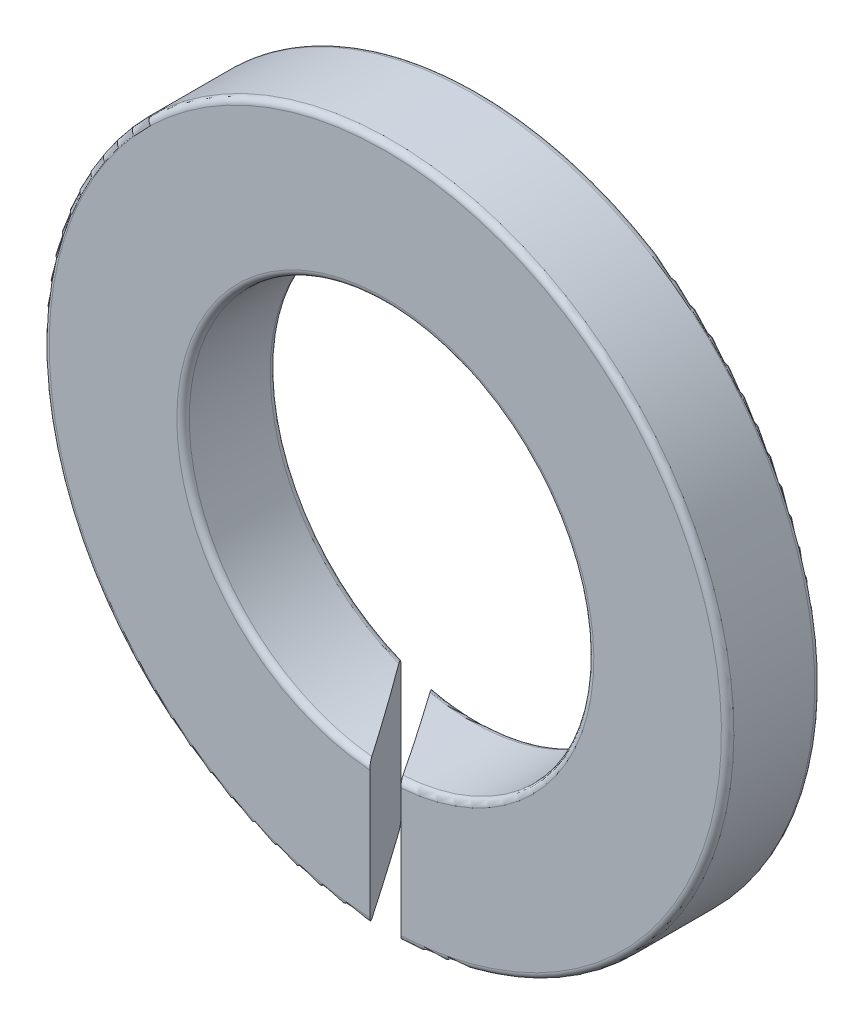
ISO-10303-21;
HEADER;
FILE_DESCRIPTION(('STEP AP214'),'2;1');
FILE_NAME('part.step','',(''),(''),'','','');
FILE_SCHEMA(('AUTOMOTIVE_DESIGN { 1 0 10303 214 1 1 1 1 }'));
ENDSEC;
DATA;
#1=APPLICATION_CONTEXT('core data for automotive mechanical design processes');
#2=APPLICATION_PROTOCOL_DEFINITION('international standard','automotive_design',2000,#1);
#3=PRODUCT_CONTEXT('',#1,'mechanical');
#4=PRODUCT('Part','Part','',(#3));
#5=PRODUCT_RELATED_PRODUCT_CATEGORY('part','',(#4));
#6=PRODUCT_DEFINITION_FORMATION('','',#4);
#7=PRODUCT_DEFINITION_CONTEXT('part definition',#1,'design');
#8=PRODUCT_DEFINITION('design','',#6,#7);
#9=PRODUCT_DEFINITION_SHAPE('','',#8);
#10=(LENGTH_UNIT() NAMED_UNIT(*) SI_UNIT(.MILLI.,.METRE.));
#11=(NAMED_UNIT(*) PLANE_ANGLE_UNIT() SI_UNIT($,.RADIAN.));
#12=(NAMED_UNIT(*) SI_UNIT($,.STERADIAN.) SOLID_ANGLE_UNIT());
#13=UNCERTAINTY_MEASURE_WITH_UNIT(LENGTH_MEASURE(1.E-05),#10,'distance_accuracy_value','');
#14=(GEOMETRIC_REPRESENTATION_CONTEXT(3) GLOBAL_UNCERTAINTY_ASSIGNED_CONTEXT((#13)) GLOBAL_UNIT_ASSIGNED_CONTEXT((#10,
#11,#12)) REPRESENTATION_CONTEXT('',''));
#15=CARTESIAN_POINT('',(0.,0.,0.));
#16=DIRECTION('',(0.,0.,1.));
#17=DIRECTION('',(1.,0.,0.));
#18=AXIS2_PLACEMENT_3D('',#15,#16,#17);
#19=CARTESIAN_POINT('',(0.,0.,-1.5));
#20=DIRECTION('',(0.,0.,1.));
#21=DIRECTION('',(1.,0.,0.));
#22=AXIS2_PLACEMENT_3D('',#19,#20,#21);
#23=CYLINDRICAL_SURFACE('',#22,5.5);
#24=CARTESIAN_POINT('',(0.,0.,-0.375));
#25=DIRECTION('',(0.832050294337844,0.,-0.554700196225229));
#26=DIRECTION('',(0.554700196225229,0.,0.832050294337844));
#27=AXIS2_PLACEMENT_3D('',#24,#25,#26);
#28=ELLIPSE('',#27,9.91526600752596,5.5);
#29=CARTESIAN_POINT('',(-0.683333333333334,-5.45738541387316,-1.4));
#30=VERTEX_POINT('',#29);
#31=CARTESIAN_POINT('',(0.183333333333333,-5.49694359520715,-0.0999999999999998));
#32=VERTEX_POINT('',#31);
#33=EDGE_CURVE('E196',#30,#32,#28,.F.);
#34=ORIENTED_EDGE('',*,*,#33,.F.);
#35=CARTESIAN_POINT('',(0.,0.,-1.4));
#36=DIRECTION('',(0.,0.,1.));
#37=DIRECTION('',(1.,0.,0.));
#38=AXIS2_PLACEMENT_3D('',#35,#36,#37);
#39=CIRCLE('',#38,5.5);
#40=CARTESIAN_POINT('',(-1.18333333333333,-5.37119374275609,-1.4));
#41=VERTEX_POINT('',#40);
#42=EDGE_CURVE('E11',#30,#41,#39,.T.);
#43=ORIENTED_EDGE('',*,*,#42,.T.);
#44=CARTESIAN_POINT('',(0.,0.,0.375));
#45=DIRECTION('',(-0.832050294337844,0.,0.554700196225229));
#46=DIRECTION('',(0.554700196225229,0.,0.832050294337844));
#47=AXIS2_PLACEMENT_3D('',#44,#45,#46);
#48=ELLIPSE('',#47,9.91526600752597,5.5);
#49=CARTESIAN_POINT('',(-0.31666666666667,-5.49087627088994,-0.100000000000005));
#50=VERTEX_POINT('',#49);
#51=EDGE_CURVE('E127',#50,#41,#48,.F.);
#52=ORIENTED_EDGE('',*,*,#51,.F.);
#53=CARTESIAN_POINT('',(0.,0.,-0.1));
#54=DIRECTION('',(0.,0.,1.));
#55=DIRECTION('',(1.,0.,0.));
#56=AXIS2_PLACEMENT_3D('',#53,#54,#55);
#57=CIRCLE('',#56,5.5);
#58=EDGE_CURVE('E41',#50,#32,#57,.F.);
#59=ORIENTED_EDGE('',*,*,#58,.T.);
#60=EDGE_LOOP('',(#34,#43,#52,#59));
#61=FACE_BOUND('',#60,.T.);
#62=ADVANCED_FACE('F34',(#61),#23,.T.);
#63=CARTESIAN_POINT('',(0.,0.,-1.5));
#64=DIRECTION('',(0.,0.,1.));
#65=DIRECTION('',(1.,0.,0.));
#66=AXIS2_PLACEMENT_3D('',#63,#64,#65);
#67=PLANE('',#66);
#68=DIRECTION('',(0.,1.,0.));
#69=VECTOR('',#68,1.);
#70=CARTESIAN_POINT('',(-0.750000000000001,-5.5,-1.5));
#71=LINE('',#70,#69);
#72=CARTESIAN_POINT('',(-0.750000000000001,-5.34766304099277,-1.5));
#73=VERTEX_POINT('',#72);
#74=CARTESIAN_POINT('',(-0.750000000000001,-3.2649655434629,-1.5));
#75=VERTEX_POINT('',#74);
#76=EDGE_CURVE('E218',#73,#75,#71,.T.);
#77=ORIENTED_EDGE('',*,*,#76,.T.);
#78=CARTESIAN_POINT('',(0.,0.,-1.5));
#79=DIRECTION('',(0.,0.,1.));
#80=DIRECTION('',(1.,0.,0.));
#81=AXIS2_PLACEMENT_3D('',#78,#79,#80);
#82=CIRCLE('',#81,3.35);
#83=CARTESIAN_POINT('',(-1.25,-3.10805405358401,-1.5));
#84=VERTEX_POINT('',#83);
#85=EDGE_CURVE('E189',#75,#84,#82,.T.);
#86=ORIENTED_EDGE('',*,*,#85,.T.);
#87=DIRECTION('',(0.,1.,0.));
#88=VECTOR('',#87,1.);
#89=CARTESIAN_POINT('',(-1.25,-5.5,-1.5));
#90=LINE('',#89,#88);
#91=CARTESIAN_POINT('',(-1.25,-5.25333227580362,-1.5));
#92=VERTEX_POINT('',#91);
#93=EDGE_CURVE('E205',#92,#84,#90,.T.);
#94=ORIENTED_EDGE('',*,*,#93,.F.);
#95=CARTESIAN_POINT('',(0.,0.,-1.5));
#96=DIRECTION('',(0.,0.,1.));
#97=DIRECTION('',(1.,0.,0.));
#98=AXIS2_PLACEMENT_3D('',#95,#96,#97);
#99=CIRCLE('',#98,5.4);
#100=EDGE_CURVE('E55',#92,#73,#99,.F.);
#101=ORIENTED_EDGE('',*,*,#100,.T.);
#102=EDGE_LOOP('',(#77,#86,#94,#101));
#103=FACE_BOUND('',#102,.T.);
#104=ADVANCED_FACE('F222',(#103),#67,.F.);
#105=CARTESIAN_POINT('',(0.,0.,0.));
#106=DIRECTION('',(0.,0.,1.));
#107=DIRECTION('',(1.,0.,0.));
#108=AXIS2_PLACEMENT_3D('',#105,#106,#107);
#109=PLANE('',#108);
#110=DIRECTION('',(0.,1.,0.));
#111=VECTOR('',#110,1.);
#112=CARTESIAN_POINT('',(-0.25,-5.5,0.));
#113=LINE('',#112,#111);
#114=CARTESIAN_POINT('',(-0.25,-5.39420985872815,0.));
#115=VERTEX_POINT('',#114);
#116=CARTESIAN_POINT('',(-0.25,-3.34065861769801,0.));
#117=VERTEX_POINT('',#116);
#118=EDGE_CURVE('E215',#115,#117,#113,.T.);
#119=ORIENTED_EDGE('',*,*,#118,.T.);
#120=CARTESIAN_POINT('',(0.,0.,0.));
#121=DIRECTION('',(0.,0.,1.));
#122=DIRECTION('',(1.,0.,0.));
#123=AXIS2_PLACEMENT_3D('',#120,#121,#122);
#124=CIRCLE('',#123,3.35);
#125=CARTESIAN_POINT('',(0.25,-3.34065861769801,0.));
#126=VERTEX_POINT('',#125);
#127=EDGE_CURVE('E105',#117,#126,#124,.F.);
#128=ORIENTED_EDGE('',*,*,#127,.T.);
#129=DIRECTION('',(0.,1.,0.));
#130=VECTOR('',#129,1.);
#131=CARTESIAN_POINT('',(0.25,-5.5,0.));
#132=LINE('',#131,#130);
#133=CARTESIAN_POINT('',(0.25,-5.39420985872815,0.));
#134=VERTEX_POINT('',#133);
#135=EDGE_CURVE('E216',#134,#126,#132,.T.);
#136=ORIENTED_EDGE('',*,*,#135,.F.);
#137=CARTESIAN_POINT('',(0.,0.,0.));
#138=DIRECTION('',(0.,0.,1.));
#139=DIRECTION('',(1.,0.,0.));
#140=AXIS2_PLACEMENT_3D('',#137,#138,#139);
#141=CIRCLE('',#140,5.4);
#142=EDGE_CURVE('E110',#134,#115,#141,.T.);
#143=ORIENTED_EDGE('',*,*,#142,.T.);
#144=EDGE_LOOP('',(#119,#128,#136,#143));
#145=FACE_BOUND('',#144,.T.);
#146=ADVANCED_FACE('F214',(#145),#109,.T.);
#147=CARTESIAN_POINT('',(0.,0.,-1.5));
#148=DIRECTION('',(0.,0.,1.));
#149=DIRECTION('',(1.,0.,0.));
#150=AXIS2_PLACEMENT_3D('',#147,#148,#149);
#151=CYLINDRICAL_SURFACE('',#150,3.25);
#152=CARTESIAN_POINT('',(0.,0.,-0.375));
#153=DIRECTION('',(0.832050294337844,0.,-0.554700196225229));
#154=DIRECTION('',(0.554700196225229,0.,0.832050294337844));
#155=AXIS2_PLACEMENT_3D('',#152,#153,#154);
#156=ELLIPSE('',#155,5.85902082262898,3.25);
#157=CARTESIAN_POINT('',(-0.683333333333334,-3.17735039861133,-1.4));
#158=VERTEX_POINT('',#157);
#159=CARTESIAN_POINT('',(0.183333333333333,-3.24482493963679,-0.1));
#160=VERTEX_POINT('',#159);
#161=EDGE_CURVE('E119',#158,#160,#156,.F.);
#162=ORIENTED_EDGE('',*,*,#161,.T.);
#163=CARTESIAN_POINT('',(0.,0.,-0.1));
#164=DIRECTION('',(0.,0.,1.));
#165=DIRECTION('',(1.,0.,0.));
#166=AXIS2_PLACEMENT_3D('',#163,#164,#165);
#167=CIRCLE('',#166,3.25);
#168=CARTESIAN_POINT('',(-0.316666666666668,-3.23453585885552,-0.100000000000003));
#169=VERTEX_POINT('',#168);
#170=EDGE_CURVE('E104',#160,#169,#167,.T.);
#171=ORIENTED_EDGE('',*,*,#170,.T.);
#172=CARTESIAN_POINT('',(0.,0.,0.375));
#173=DIRECTION('',(-0.832050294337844,0.,0.554700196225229));
#174=DIRECTION('',(0.554700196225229,0.,0.832050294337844));
#175=AXIS2_PLACEMENT_3D('',#172,#173,#174);
#176=ELLIPSE('',#175,5.85902082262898,3.25);
#177=CARTESIAN_POINT('',(-1.18333333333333,-3.02691628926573,-1.4));
#178=VERTEX_POINT('',#177);
#179=EDGE_CURVE('E117',#169,#178,#176,.F.);
#180=ORIENTED_EDGE('',*,*,#179,.T.);
#181=CARTESIAN_POINT('',(0.,0.,-1.4));
#182=DIRECTION('',(0.,0.,1.));
#183=DIRECTION('',(1.,0.,0.));
#184=AXIS2_PLACEMENT_3D('',#181,#182,#183);
#185=CIRCLE('',#184,3.25);
#186=EDGE_CURVE('E121',#178,#158,#185,.F.);
#187=ORIENTED_EDGE('',*,*,#186,.T.);
#188=EDGE_LOOP('',(#162,#171,#180,#187));
#189=FACE_BOUND('',#188,.T.);
#190=ADVANCED_FACE('F116',(#189),#151,.F.);
#191=CARTESIAN_POINT('',(0.25,-5.5,0.));
#192=DIRECTION('',(0.832050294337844,0.,-0.554700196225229));
#193=DIRECTION('',(-0.554700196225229,0.,-0.832050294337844));
#194=AXIS2_PLACEMENT_3D('',#191,#192,#193);
#195=PLANE('',#194);
#196=ORIENTED_EDGE('',*,*,#135,.T.);
#197=CARTESIAN_POINT('',(0.25,-3.34065861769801,0.));
#198=CARTESIAN_POINT('',(0.250004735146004,-3.33584184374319,7.10271900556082E-06));
#199=CARTESIAN_POINT('',(0.249769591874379,-3.33102811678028,-0.000345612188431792));
#200=CARTESIAN_POINT('',(0.248845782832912,-3.32156400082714,-0.00173132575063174));
#201=CARTESIAN_POINT('',(0.24815897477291,-3.31691302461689,-0.00276153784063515));
#202=CARTESIAN_POINT('',(0.2463578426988,-3.30789072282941,-0.0054632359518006));
#203=CARTESIAN_POINT('',(0.245243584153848,-3.30351935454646,-0.00713462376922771));
#204=CARTESIAN_POINT('',(0.242637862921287,-3.29515831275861,-0.0110432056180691));
#205=CARTESIAN_POINT('',(0.241146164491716,-3.29116887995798,-0.0132807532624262));
#206=CARTESIAN_POINT('',(0.237783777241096,-3.28350687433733,-0.0183243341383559));
#207=CARTESIAN_POINT('',(0.235901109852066,-3.27985148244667,-0.0211483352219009));
#208=CARTESIAN_POINT('',(0.231861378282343,-3.27307469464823,-0.0272079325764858));
#209=CARTESIAN_POINT('',(0.229704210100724,-3.2699535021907,-0.0304436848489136));
#210=CARTESIAN_POINT('',(0.224846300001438,-3.26384679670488,-0.0377305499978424));
#211=CARTESIAN_POINT('',(0.222112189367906,-3.26094775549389,-0.0418317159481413));
#212=CARTESIAN_POINT('',(0.216444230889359,-3.25587336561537,-0.0503336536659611));
#213=CARTESIAN_POINT('',(0.213510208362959,-3.25369865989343,-0.0547346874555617));
#214=CARTESIAN_POINT('',(0.206969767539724,-3.24973318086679,-0.0645453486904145));
#215=CARTESIAN_POINT('',(0.203337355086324,-3.24808189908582,-0.069993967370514));
#216=CARTESIAN_POINT('',(0.195982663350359,-3.24574247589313,-0.0810260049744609));
#217=CARTESIAN_POINT('',(0.192260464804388,-3.24505349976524,-0.0866093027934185));
#218=CARTESIAN_POINT('',(0.186799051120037,-3.24472913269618,-0.0948014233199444));
#219=CARTESIAN_POINT('',(0.185064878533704,-3.24472718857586,-0.0974026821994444));
#220=CARTESIAN_POINT('',(0.183333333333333,-3.24482493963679,-0.1));
#221=B_SPLINE_CURVE_WITH_KNOTS('',3,(#197,#198,#199,#200,#201,#202,#203,#204,#205,#206,#207,
#208,#209,#210,#211,#212,#213,#214,#215,#216,#217,#218,#219,#220),.UNSPECIFIED.,.F.,.F.,(4,2,2,
2,2,2,2,2,2,2,2,4),(0.,0.0144264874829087,0.0287940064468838,0.0431593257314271,
0.0575336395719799,0.0724396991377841,0.0873514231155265,0.104442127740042,0.121547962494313,
0.141731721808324,0.161897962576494,0.171269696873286),.UNSPECIFIED.);
#222=EDGE_CURVE('E178',#126,#160,#221,.T.);
#223=ORIENTED_EDGE('',*,*,#222,.T.);
#224=ORIENTED_EDGE('',*,*,#161,.F.);
#225=CARTESIAN_POINT('',(-0.683333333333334,-3.17735039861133,-1.4));
#226=CARTESIAN_POINT('',(-0.688001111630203,-3.17634482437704,-1.4070016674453));
#227=CARTESIAN_POINT('',(-0.692742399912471,-3.17607009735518,-1.41411359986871));
#228=CARTESIAN_POINT('',(-0.702197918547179,-3.17714094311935,-1.42829687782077));
#229=CARTESIAN_POINT('',(-0.706911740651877,-3.17849763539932,-1.43536761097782));
#230=CARTESIAN_POINT('',(-0.71458906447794,-3.18227929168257,-1.44688359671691));
#231=CARTESIAN_POINT('',(-0.717625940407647,-3.184217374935,-1.45143891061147));
#232=CARTESIAN_POINT('',(-0.723480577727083,-3.18895367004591,-1.46022086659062));
#233=CARTESIAN_POINT('',(-0.726298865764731,-3.19174972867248,-1.4644482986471));
#234=CARTESIAN_POINT('',(-0.731639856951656,-3.19824385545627,-1.47245978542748));
#235=CARTESIAN_POINT('',(-0.734159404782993,-3.20195046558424,-1.47623910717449));
#236=CARTESIAN_POINT('',(-0.738740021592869,-3.2101951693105,-1.4831100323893));
#237=CARTESIAN_POINT('',(-0.740801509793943,-3.21473249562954,-1.48620226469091));
#238=CARTESIAN_POINT('',(-0.74408665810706,-3.2237709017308,-1.49112998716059));
#239=CARTESIAN_POINT('',(-0.745388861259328,-3.22817965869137,-1.49308329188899));
#240=CARTESIAN_POINT('',(-0.747522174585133,-3.23735441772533,-1.4962832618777));
#241=CARTESIAN_POINT('',(-0.748353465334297,-3.24212028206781,-1.49753019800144));
#242=CARTESIAN_POINT('',(-0.749295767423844,-3.2499333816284,-1.49894365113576));
#243=CARTESIAN_POINT('',(-0.749561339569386,-3.25292341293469,-1.49934200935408));
#244=CARTESIAN_POINT('',(-0.749913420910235,-3.25893067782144,-1.49987013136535));
#245=CARTESIAN_POINT('',(-0.750000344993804,-3.26194783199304,-1.5000005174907));
#246=CARTESIAN_POINT('',(-0.750000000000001,-3.2649655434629,-1.5));
#247=B_SPLINE_CURVE_WITH_KNOTS('',3,(#225,#226,#227,#228,#229,#230,#231,#232,#233,#234,#235,
#236,#237,#238,#239,#240,#241,#242,#243,#244,#245,#246),.UNSPECIFIED.,.F.,.F.,(4,2,2,2,2,2,2,2,
2,2,4),(0.,0.0254673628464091,0.051109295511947,0.0684651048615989,0.0857777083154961,
0.103259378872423,0.120724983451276,0.13562847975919,0.150526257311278,0.159594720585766,
0.168642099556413),.UNSPECIFIED.);
#248=EDGE_CURVE('E48',#158,#75,#247,.T.);
#249=ORIENTED_EDGE('',*,*,#248,.T.);
#250=ORIENTED_EDGE('',*,*,#76,.F.);
#251=CARTESIAN_POINT('',(-0.750000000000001,-5.34766304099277,-1.5));
#252=CARTESIAN_POINT('',(-0.750003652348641,-5.35299661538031,-1.50000547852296));
#253=CARTESIAN_POINT('',(-0.749721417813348,-5.35831562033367,-1.49958212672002));
#254=CARTESIAN_POINT('',(-0.748645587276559,-5.36874900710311,-1.49796838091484));
#255=CARTESIAN_POINT('',(-0.747855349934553,-5.3738645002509,-1.49678302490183));
#256=CARTESIAN_POINT('',(-0.745825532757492,-5.38377390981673,-1.49373829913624));
#257=CARTESIAN_POINT('',(-0.744587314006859,-5.38856874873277,-1.49188097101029));
#258=CARTESIAN_POINT('',(-0.741725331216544,-5.39777500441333,-1.48758799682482));
#259=CARTESIAN_POINT('',(-0.740100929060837,-5.40218576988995,-1.48515139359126));
#260=CARTESIAN_POINT('',(-0.736330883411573,-5.41102429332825,-1.47949632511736));
#261=CARTESIAN_POINT('',(-0.734147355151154,-5.41539934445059,-1.47622103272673));
#262=CARTESIAN_POINT('',(-0.729459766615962,-5.42354614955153,-1.46918964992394));
#263=CARTESIAN_POINT('',(-0.726955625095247,-5.42731775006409,-1.46543343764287));
#264=CARTESIAN_POINT('',(-0.721231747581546,-5.4348342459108,-1.45684762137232));
#265=CARTESIAN_POINT('',(-0.717963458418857,-5.43845907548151,-1.45194518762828));
#266=CARTESIAN_POINT('',(-0.711166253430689,-5.44480487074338,-1.44174938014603));
#267=CARTESIAN_POINT('',(-0.707637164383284,-5.44752522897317,-1.43645574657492));
#268=CARTESIAN_POINT('',(-0.700680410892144,-5.4518583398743,-1.42602061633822));
#269=CARTESIAN_POINT('',(-0.697265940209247,-5.45354037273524,-1.42089891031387));
#270=CARTESIAN_POINT('',(-0.690350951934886,-5.45608247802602,-1.41052642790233));
#271=CARTESIAN_POINT('',(-0.686850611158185,-5.4569441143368,-1.40527591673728));
#272=CARTESIAN_POINT('',(-0.683333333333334,-5.45738541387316,-1.4));
#273=B_SPLINE_CURVE_WITH_KNOTS('',3,(#251,#252,#253,#254,#255,#256,#257,#258,#259,#260,#261,
#262,#263,#264,#265,#266,#267,#268,#269,#270,#271,#272),.UNSPECIFIED.,.F.,.F.,(4,2,2,2,2,2,2,2,
2,2,4),(0.,0.0159547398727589,0.0318050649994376,0.0476076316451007,0.0634364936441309,
0.081026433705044,0.0986208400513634,0.119292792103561,0.139978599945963,0.159067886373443,
0.178120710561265),.UNSPECIFIED.);
#274=EDGE_CURVE('E179',#73,#30,#273,.T.);
#275=ORIENTED_EDGE('',*,*,#274,.T.);
#276=ORIENTED_EDGE('',*,*,#33,.T.);
#277=CARTESIAN_POINT('',(0.183333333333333,-5.49694359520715,-0.1));
#278=CARTESIAN_POINT('',(0.188035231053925,-5.49678627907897,-0.0929471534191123));
#279=CARTESIAN_POINT('',(0.192734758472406,-5.49587699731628,-0.085897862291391));
#280=CARTESIAN_POINT('',(0.202002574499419,-5.49255270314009,-0.0719961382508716));
#281=CARTESIAN_POINT('',(0.206569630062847,-5.49012656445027,-0.0651455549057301));
#282=CARTESIAN_POINT('',(0.215078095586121,-5.48398116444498,-0.0523828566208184));
#283=CARTESIAN_POINT('',(0.219040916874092,-5.480358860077,-0.0464386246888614));
#284=CARTESIAN_POINT('',(0.226503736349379,-5.47183086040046,-0.0352443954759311));
#285=CARTESIAN_POINT('',(0.230005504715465,-5.46693030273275,-0.0299917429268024));
#286=CARTESIAN_POINT('',(0.235456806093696,-5.45748170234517,-0.0218147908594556));
#287=CARTESIAN_POINT('',(0.237564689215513,-5.45322906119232,-0.0186529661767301));
#288=CARTESIAN_POINT('',(0.241366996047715,-5.44415103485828,-0.0129495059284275));
#289=CARTESIAN_POINT('',(0.243061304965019,-5.43932549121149,-0.010408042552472));
#290=CARTESIAN_POINT('',(0.245956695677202,-5.42916346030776,-0.00606495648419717));
#291=CARTESIAN_POINT('',(0.247153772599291,-5.42382323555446,-0.00426934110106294));
#292=CARTESIAN_POINT('',(0.248948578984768,-5.41283117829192,-0.00157713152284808));
#293=CARTESIAN_POINT('',(0.249548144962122,-5.40718035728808,-0.000677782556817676));
#294=CARTESIAN_POINT('',(0.249882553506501,-5.40027894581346,-0.000176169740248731));
#295=CARTESIAN_POINT('',(0.249926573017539,-5.39906576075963,-0.00011014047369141));
#296=CARTESIAN_POINT('',(0.249985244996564,-5.39663851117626,-2.21325051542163E-05));
#297=CARTESIAN_POINT('',(0.249999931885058,-5.39542444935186,-1.02172413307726E-07));
#298=CARTESIAN_POINT('',(0.25,-5.39420985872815,0.));
#299=B_SPLINE_CURVE_WITH_KNOTS('',3,(#277,#278,#279,#280,#281,#282,#283,#284,#285,#286,#287,
#288,#289,#290,#291,#292,#293,#294,#295,#296,#297,#298),.UNSPECIFIED.,.F.,.F.,(4,2,2,2,2,2,2,2,
2,2,4),(0.,0.0254179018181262,0.051024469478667,0.0749244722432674,0.0987298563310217,
0.115772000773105,0.132818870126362,0.150000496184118,0.167129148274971,0.170775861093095,
0.174418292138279),.UNSPECIFIED.);
#300=EDGE_CURVE('E202',#32,#134,#299,.T.);
#301=ORIENTED_EDGE('',*,*,#300,.T.);
#302=EDGE_LOOP('',(#196,#223,#224,#249,#250,#275,#276,#301));
#303=FACE_BOUND('',#302,.T.);
#304=ADVANCED_FACE('F149',(#303),#195,.F.);
#305=CARTESIAN_POINT('',(-1.25,-5.5,-1.5));
#306=DIRECTION('',(-0.832050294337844,0.,0.554700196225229));
#307=DIRECTION('',(0.554700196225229,0.,0.832050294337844));
#308=AXIS2_PLACEMENT_3D('',#305,#306,#307);
#309=PLANE('',#308);
#310=ORIENTED_EDGE('',*,*,#179,.F.);
#311=CARTESIAN_POINT('',(-0.316666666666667,-3.23453585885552,-0.1));
#312=CARTESIAN_POINT('',(-0.311976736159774,-3.23499849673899,-0.0929651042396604));
#313=CARTESIAN_POINT('',(-0.307305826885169,-3.2361882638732,-0.0859587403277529));
#314=CARTESIAN_POINT('',(-0.298112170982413,-3.24000744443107,-0.0721682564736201));
#315=CARTESIAN_POINT('',(-0.293590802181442,-3.24264761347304,-0.065386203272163));
#316=CARTESIAN_POINT('',(-0.285015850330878,-3.2492417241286,-0.0525237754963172));
#317=CARTESIAN_POINT('',(-0.280952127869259,-3.25315253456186,-0.0464281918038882));
#318=CARTESIAN_POINT('',(-0.273313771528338,-3.26227467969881,-0.0349706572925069));
#319=CARTESIAN_POINT('',(-0.269737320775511,-3.26748096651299,-0.029605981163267));
#320=CARTESIAN_POINT('',(-0.26421739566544,-3.27742000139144,-0.0213260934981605));
#321=CARTESIAN_POINT('',(-0.26210247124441,-3.28184466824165,-0.0181537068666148));
#322=CARTESIAN_POINT('',(-0.258299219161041,-3.29126445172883,-0.0124488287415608));
#323=CARTESIAN_POINT('',(-0.25661102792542,-3.29625975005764,-0.00991654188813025));
#324=CARTESIAN_POINT('',(-0.253745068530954,-3.30676560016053,-0.0056176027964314));
#325=CARTESIAN_POINT('',(-0.252571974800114,-3.31228034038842,-0.0038579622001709));
#326=CARTESIAN_POINT('',(-0.250853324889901,-3.3236091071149,-0.001279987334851));
#327=CARTESIAN_POINT('',(-0.250305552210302,-3.32942199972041,-0.000458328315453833));
#328=CARTESIAN_POINT('',(-0.250031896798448,-3.33706119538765,-4.78451976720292E-05));
#329=CARTESIAN_POINT('',(-0.249999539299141,-3.33886035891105,6.91051288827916E-07));
#330=CARTESIAN_POINT('',(-0.25,-3.34065861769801,0.));
#331=B_SPLINE_CURVE_WITH_KNOTS('',3,(#311,#312,#313,#314,#315,#316,#317,#318,#319,#320,#321,
#322,#323,#324,#325,#326,#327,#328,#329,#330),.UNSPECIFIED.,.F.,.F.,(4,2,2,2,2,2,2,2,2,4),(0.,
0.0253816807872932,0.0509541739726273,0.0757362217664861,0.100423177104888,0.117878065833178,
0.135338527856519,0.152954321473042,0.170507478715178,0.175904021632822),.UNSPECIFIED.);
#332=EDGE_CURVE('E100',#169,#117,#331,.T.);
#333=ORIENTED_EDGE('',*,*,#332,.T.);
#334=ORIENTED_EDGE('',*,*,#118,.F.);
#335=CARTESIAN_POINT('',(-0.25,-5.39420985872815,0.));
#336=CARTESIAN_POINT('',(-0.249995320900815,-5.39907152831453,7.01864877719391E-06));
#337=CARTESIAN_POINT('',(-0.250235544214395,-5.4039287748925,-0.000353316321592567));
#338=CARTESIAN_POINT('',(-0.251175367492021,-5.41347517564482,-0.00176305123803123));
#339=CARTESIAN_POINT('',(-0.251872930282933,-5.41816497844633,-0.00280939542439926));
#340=CARTESIAN_POINT('',(-0.253696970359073,-5.42726019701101,-0.00554545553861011));
#341=CARTESIAN_POINT('',(-0.254823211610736,-5.43166576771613,-0.00723481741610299));
#342=CARTESIAN_POINT('',(-0.257452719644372,-5.44009588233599,-0.0111790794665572));
#343=CARTESIAN_POINT('',(-0.258956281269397,-5.44412012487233,-0.0134344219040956));
#344=CARTESIAN_POINT('',(-0.26235637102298,-5.45188550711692,-0.0185345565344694));
#345=CARTESIAN_POINT('',(-0.264267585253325,-5.45560563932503,-0.021401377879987));
#346=CARTESIAN_POINT('',(-0.268369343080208,-5.46250338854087,-0.027554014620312));
#347=CARTESIAN_POINT('',(-0.270559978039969,-5.46568082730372,-0.0308399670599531));
#348=CARTESIAN_POINT('',(-0.275493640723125,-5.47189383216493,-0.0382404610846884));
#349=CARTESIAN_POINT('',(-0.278270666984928,-5.47484150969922,-0.0424060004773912));
#350=CARTESIAN_POINT('',(-0.284030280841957,-5.47999223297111,-0.0510454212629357));
#351=CARTESIAN_POINT('',(-0.287013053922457,-5.48219459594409,-0.0555195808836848));
#352=CARTESIAN_POINT('',(-0.293621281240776,-5.4861648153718,-0.0654319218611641));
#353=CARTESIAN_POINT('',(-0.29727125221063,-5.48779993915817,-0.0709068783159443));
#354=CARTESIAN_POINT('',(-0.304660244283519,-5.49008430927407,-0.0819903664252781));
#355=CARTESIAN_POINT('',(-0.308399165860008,-5.49073460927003,-0.0875987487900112));
#356=CARTESIAN_POINT('',(-0.313650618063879,-5.49097282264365,-0.0954759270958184));
#357=CARTESIAN_POINT('',(-0.315159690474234,-5.49096321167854,-0.0977395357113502));
#358=CARTESIAN_POINT('',(-0.316666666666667,-5.49087627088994,-0.1));
#359=B_SPLINE_CURVE_WITH_KNOTS('',3,(#335,#336,#337,#338,#339,#340,#341,#342,#343,#344,#345,
#346,#347,#348,#349,#350,#351,#352,#353,#354,#355,#356,#357,#358),.UNSPECIFIED.,.F.,.F.,(4,2,2,
2,2,2,2,2,2,2,2,4),(0.,0.0145585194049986,0.0290526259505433,0.0435387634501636,
0.0580362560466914,0.0731888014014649,0.0883463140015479,0.105708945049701,0.123087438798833,
0.143349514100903,0.163589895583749,0.171746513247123),.UNSPECIFIED.);
#360=EDGE_CURVE('E120',#115,#50,#359,.T.);
#361=ORIENTED_EDGE('',*,*,#360,.T.);
#362=ORIENTED_EDGE('',*,*,#51,.T.);
#363=CARTESIAN_POINT('',(-1.18333333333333,-5.37119374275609,-1.4));
#364=CARTESIAN_POINT('',(-1.18800999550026,-5.37015991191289,-1.40701499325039));
#365=CARTESIAN_POINT('',(-1.192632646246,-5.36838308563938,-1.41394896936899));
#366=CARTESIAN_POINT('',(-1.20165565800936,-5.36343649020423,-1.42748348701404));
#367=CARTESIAN_POINT('',(-1.20605544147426,-5.36026328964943,-1.43408316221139));
#368=CARTESIAN_POINT('',(-1.21441500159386,-5.35269468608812,-1.44662250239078));
#369=CARTESIAN_POINT('',(-1.21838148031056,-5.34832330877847,-1.45257222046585));
#370=CARTESIAN_POINT('',(-1.22583583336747,-5.33841564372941,-1.4637537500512));
#371=CARTESIAN_POINT('',(-1.22932434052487,-5.33288092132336,-1.46898651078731));
#372=CARTESIAN_POINT('',(-1.2350470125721,-5.32193660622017,-1.47757051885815));
#373=CARTESIAN_POINT('',(-1.23739293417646,-5.31671652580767,-1.48108940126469));
#374=CARTESIAN_POINT('',(-1.24158239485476,-5.30565229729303,-1.48737359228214));
#375=CARTESIAN_POINT('',(-1.24342625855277,-5.29980855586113,-1.49013938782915));
#376=CARTESIAN_POINT('',(-1.24622542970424,-5.28869596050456,-1.49433814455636));
#377=CARTESIAN_POINT('',(-1.2472802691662,-5.28350858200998,-1.49592040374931));
#378=CARTESIAN_POINT('',(-1.24890165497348,-5.2728990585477,-1.49835248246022));
#379=CARTESIAN_POINT('',(-1.24946963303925,-5.267477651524,-1.49920444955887));
#380=CARTESIAN_POINT('',(-1.24992080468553,-5.25912730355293,-1.49988120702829));
#381=CARTESIAN_POINT('',(-1.2500006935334,-5.25622995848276,-1.5000010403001));
#382=CARTESIAN_POINT('',(-1.25,-5.25333227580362,-1.5));
#383=B_SPLINE_CURVE_WITH_KNOTS('',3,(#363,#364,#365,#366,#367,#368,#369,#370,#371,#372,#373,
#374,#375,#376,#377,#378,#379,#380,#381,#382),.UNSPECIFIED.,.F.,.F.,(4,2,2,2,2,2,2,2,2,4),(0.,
0.0254418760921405,0.0509466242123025,0.0759732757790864,0.100966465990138,0.121043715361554,
0.141107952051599,0.157618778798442,0.174080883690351,0.182771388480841),.UNSPECIFIED.);
#384=EDGE_CURVE('E137',#41,#92,#383,.T.);
#385=ORIENTED_EDGE('',*,*,#384,.T.);
#386=ORIENTED_EDGE('',*,*,#93,.T.);
#387=CARTESIAN_POINT('',(-1.25,-3.10805405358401,-1.5));
#388=CARTESIAN_POINT('',(-1.25000292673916,-3.10336989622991,-1.50000439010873));
#389=CARTESIAN_POINT('',(-1.24981120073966,-3.09867577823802,-1.49971680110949));
#390=CARTESIAN_POINT('',(-1.24901753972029,-3.08938594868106,-1.49852630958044));
#391=CARTESIAN_POINT('',(-1.2484141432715,-3.08479064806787,-1.49762121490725));
#392=CARTESIAN_POINT('',(-1.24677243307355,-3.07583304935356,-1.49515864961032));
#393=CARTESIAN_POINT('',(-1.2457322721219,-3.07147183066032,-1.49359840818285));
#394=CARTESIAN_POINT('',(-1.24323241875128,-3.0631703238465,-1.48984862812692));
#395=CARTESIAN_POINT('',(-1.2417736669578,-3.05922911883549,-1.4876605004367));
#396=CARTESIAN_POINT('',(-1.23858884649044,-3.05213397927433,-1.48288326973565));
#397=CARTESIAN_POINT('',(-1.23688635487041,-3.04894550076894,-1.48032953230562));
#398=CARTESIAN_POINT('',(-1.23321047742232,-3.04312189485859,-1.47481571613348));
#399=CARTESIAN_POINT('',(-1.23123689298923,-3.04048717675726,-1.47185533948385));
#400=CARTESIAN_POINT('',(-1.22706087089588,-3.03578056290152,-1.46559130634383));
#401=CARTESIAN_POINT('',(-1.22485593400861,-3.03371592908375,-1.46228390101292));
#402=CARTESIAN_POINT('',(-1.22030392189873,-3.03018926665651,-1.4554558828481));
#403=CARTESIAN_POINT('',(-1.21795680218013,-3.02872742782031,-1.45193520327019));
#404=CARTESIAN_POINT('',(-1.21219525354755,-3.02589722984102,-1.44329288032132));
#405=CARTESIAN_POINT('',(-1.20873764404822,-3.02481272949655,-1.43810646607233));
#406=CARTESIAN_POINT('',(-1.20177044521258,-3.0236701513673,-1.42765566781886));
#407=CARTESIAN_POINT('',(-1.1982607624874,-3.02361421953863,-1.42239114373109));
#408=CARTESIAN_POINT('',(-1.19092047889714,-3.02445561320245,-1.41138071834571));
#409=CARTESIAN_POINT('',(-1.18709301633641,-3.02544916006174,-1.40563952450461));
#410=CARTESIAN_POINT('',(-1.18333333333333,-3.02691628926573,-1.4));
#411=B_SPLINE_CURVE_WITH_KNOTS('',3,(#387,#388,#389,#390,#391,#392,#393,#394,#395,#396,#397,
#398,#399,#400,#401,#402,#403,#404,#405,#406,#407,#408,#409,#410),.UNSPECIFIED.,.F.,.F.,(4,2,2,
2,2,2,2,2,2,2,2,4),(0.,0.0140545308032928,0.0281592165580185,0.0423241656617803,
0.0564575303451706,0.0696710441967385,0.082894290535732,0.0962789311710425,0.109667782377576,
0.128543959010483,0.147459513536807,0.168273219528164),.UNSPECIFIED.);
#412=EDGE_CURVE('E111',#84,#178,#411,.T.);
#413=ORIENTED_EDGE('',*,*,#412,.T.);
#414=EDGE_LOOP('',(#310,#333,#334,#361,#362,#385,#386,#413));
#415=FACE_BOUND('',#414,.T.);
#416=ADVANCED_FACE('F123',(#415),#309,.F.);
#417=CARTESIAN_POINT('',(0.,0.,-0.1));
#418=DIRECTION('',(0.,0.,1.));
#419=DIRECTION('',(1.,0.,0.));
#420=AXIS2_PLACEMENT_3D('',#417,#418,#419);
#421=TOROIDAL_SURFACE('',#420,3.35,0.1);
#422=ORIENTED_EDGE('',*,*,#222,.F.);
#423=ORIENTED_EDGE('',*,*,#127,.F.);
#424=ORIENTED_EDGE('',*,*,#332,.F.);
#425=ORIENTED_EDGE('',*,*,#170,.F.);
#426=EDGE_LOOP('',(#422,#423,#424,#425));
#427=FACE_BOUND('',#426,.T.);
#428=ADVANCED_FACE('F103',(#427),#421,.T.);
#429=CARTESIAN_POINT('',(0.,0.,-1.4));
#430=DIRECTION('',(0.,0.,1.));
#431=DIRECTION('',(1.,0.,0.));
#432=AXIS2_PLACEMENT_3D('',#429,#430,#431);
#433=TOROIDAL_SURFACE('',#432,3.35,0.1);
#434=ORIENTED_EDGE('',*,*,#248,.F.);
#435=ORIENTED_EDGE('',*,*,#186,.F.);
#436=ORIENTED_EDGE('',*,*,#412,.F.);
#437=ORIENTED_EDGE('',*,*,#85,.F.);
#438=EDGE_LOOP('',(#434,#435,#436,#437));
#439=FACE_BOUND('',#438,.T.);
#440=ADVANCED_FACE('F164',(#439),#433,.T.);
#441=CARTESIAN_POINT('',(0.,0.,-1.4));
#442=DIRECTION('',(0.,0.,1.));
#443=DIRECTION('',(1.,0.,0.));
#444=AXIS2_PLACEMENT_3D('',#441,#442,#443);
#445=TOROIDAL_SURFACE('',#444,5.4,0.1);
#446=ORIENTED_EDGE('',*,*,#274,.F.);
#447=ORIENTED_EDGE('',*,*,#100,.F.);
#448=ORIENTED_EDGE('',*,*,#384,.F.);
#449=ORIENTED_EDGE('',*,*,#42,.F.);
#450=EDGE_LOOP('',(#446,#447,#448,#449));
#451=FACE_BOUND('',#450,.T.);
#452=ADVANCED_FACE('F167',(#451),#445,.T.);
#453=CARTESIAN_POINT('',(0.,0.,-0.1));
#454=DIRECTION('',(0.,0.,1.));
#455=DIRECTION('',(1.,0.,0.));
#456=AXIS2_PLACEMENT_3D('',#453,#454,#455);
#457=TOROIDAL_SURFACE('',#456,5.4,0.1);
#458=ORIENTED_EDGE('',*,*,#300,.F.);
#459=ORIENTED_EDGE('',*,*,#58,.F.);
#460=ORIENTED_EDGE('',*,*,#360,.F.);
#461=ORIENTED_EDGE('',*,*,#142,.F.);
#462=EDGE_LOOP('',(#458,#459,#460,#461));
#463=FACE_BOUND('',#462,.T.);
#464=ADVANCED_FACE('F143',(#463),#457,.T.);
#465=CLOSED_SHELL('',(#62,#104,#146,#190,#304,#416,#428,#440,#452,#464));
#466=MANIFOLD_SOLID_BREP('B2',#465);
#467=ADVANCED_BREP_SHAPE_REPRESENTATION('',(#18,#466),#14);
#468=SHAPE_DEFINITION_REPRESENTATION(#9,#467);
ENDSEC;
END-ISO-10303-21;
